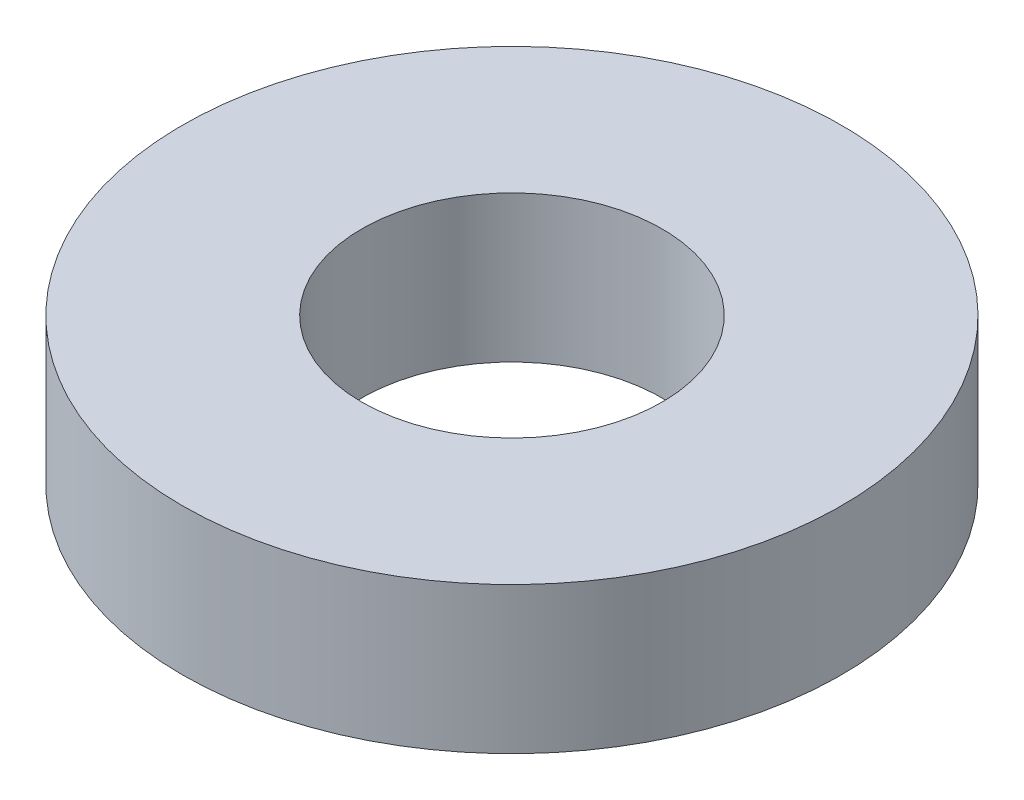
from build123d import *

# Parameters (mm, degrees)
ESQUISSE1_R      = 9
ESQUISSE1_R_2    = 4.1
EXTRUSION1_DEPTH = 4


with BuildPart() as part:
    # Esquisse1 → Extrusion1 (new body)
    with BuildSketch(Plane(origin=(0, 0, 0), x_dir=(1, 0, 0), z_dir=(0, 1, 0))):
        with Locations(Location((0, 0, 0), (0, 0, 270))):
            Circle(ESQUISSE1_R)
        with Locations(Location((0, 0, 0), (0, 0, 270))):
            Circle(ESQUISSE1_R_2, mode=Mode.SUBTRACT)
    extrude(amount=EXTRUSION1_DEPTH)


solid = part.part
